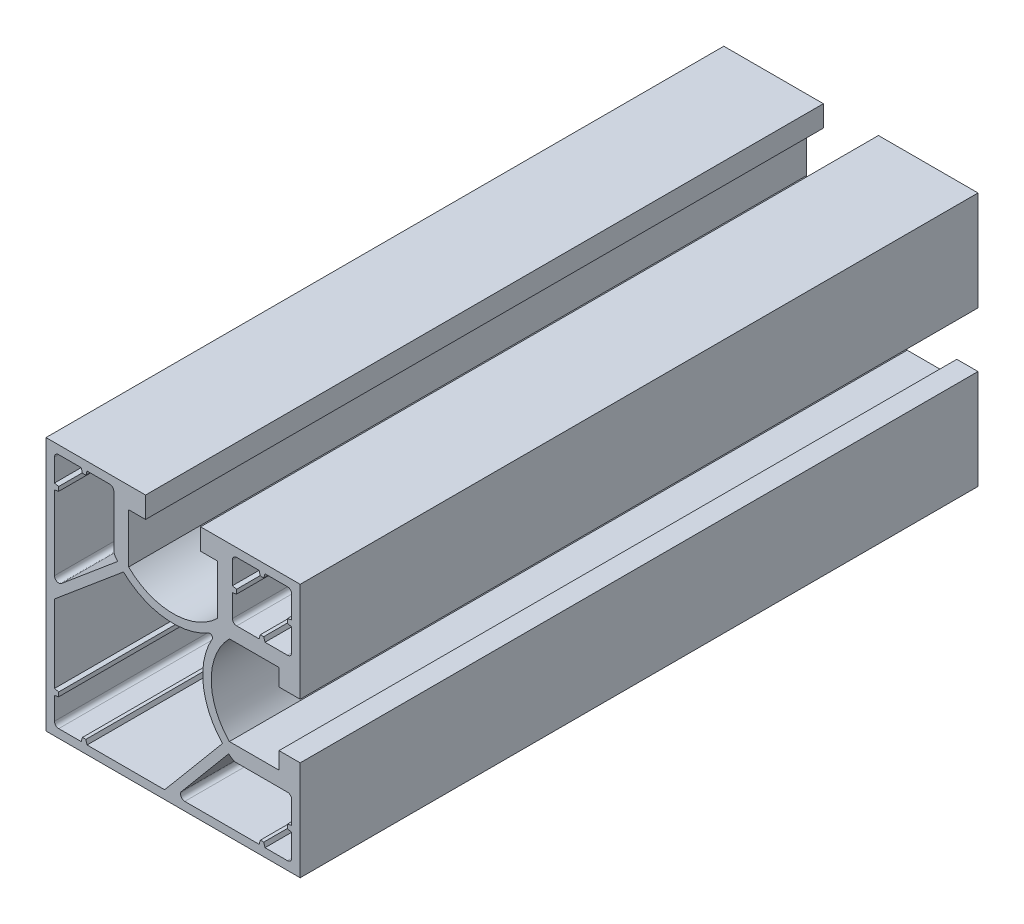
from build123d import *

# Parameters (mm, degrees)
EXTRUDE_1_DEPTH = 40
FILLET_1_R      = 0.5
FILLET_2_R      = 0.5


with BuildPart() as part:
    # Sketch 1 → Extrude 1 (new, symmetric)
    with BuildSketch(Plane.XY):
        with BuildLine():
            Line((-15, 15), (-3.25, 15))
            Line((-3.25, 15), (-3.25, 12.5))
            Line((-3.25, 12.5), (-5.25, 12.5))
            Line((-5.25, 12.5), (-5.25, 6.643928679))
            ThreePointArc((-5.25, 6.643928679), (0, 4.5), (5.25, 6.643928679))
            Line((5.25, 6.643928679), (5.25, 12.5))
            Line((5.25, 12.5), (3.25, 12.5))
            Line((3.25, 12.5), (3.25, 15))
            Line((3.25, 15), (15, 15))
            Line((15, 15), (15, 3.25))
            Line((15, 3.25), (12.5, 3.25))
            Line((12.5, 3.25), (12.5, 5.25))
            Line((12.5, 5.25), (6.643928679, 5.25))
            ThreePointArc((6.643928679, 5.25), (4.5, 0), (6.643928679, -5.25))
            Line((6.643928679, -5.25), (12.5, -5.25))
            Line((12.5, -5.25), (12.5, -3.25))
            Line((12.5, -3.25), (15, -3.25))
            Line((15, -3.25), (15, -15))
            Line((15, -15), (-15, -15))
            Line((-15, -15), (-15, 15))
        make_face()
        with BuildLine():
            Line((-7, 14), (-7, 7.5))
            ThreePointArc((-7, 7.5), (-6.948683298, 7.183772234), (-6.8, 6.9))
            ThreePointArc((-6.8, 6.9), (-6.670725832, 6.732038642), (-6.537304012, 6.56735274))
            Line((-6.537304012, 6.56735274), (-14, 0.305407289))
            Line((-14, 0.305407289), (-14, 10.15))
            Line((-14, 10.15), (-13.5, 10.25))
            Line((-13.5, 10.25), (-13.5, 10.75))
            Line((-13.5, 10.75), (-14, 10.85))
            Line((-14, 10.85), (-14, 14))
            Line((-14, 14), (-10.85, 14))
            Line((-10.85, 14), (-10.7, 13.5))
            Line((-10.7, 13.5), (-10.3, 13.5))
            Line((-10.3, 13.5), (-10.15, 14))
            Line((-10.15, 14), (-7, 14))
        make_face(mode=Mode.SUBTRACT)
        Polygon((7, 14), (10.15, 14), (10.3, 13.5), (10.7, 13.5), (10.85, 14), (14, 14), (14, 10.85), (13.5, 10.75), (13.5, 10.25), (14, 10.15), (14, 7), (10.85, 7), (10.7, 7.5), (10.3, 7.5), (10.15, 7), (7, 7), (7, 10.15), (7.5, 10.25), (7.5, 10.75), (7, 10.85), align=None, mode=Mode.SUBTRACT)
        with BuildLine():
            Line((7.5, -7), (14, -7))
            Line((14, -7), (14, -10.15))
            Line((14, -10.15), (13.5, -10.25))
            Line((13.5, -10.25), (13.5, -10.75))
            Line((13.5, -10.75), (14, -10.85))
            Line((14, -10.85), (14, -14))
            Line((14, -14), (10.85, -14))
            Line((10.85, -14), (10.7, -13.5))
            Line((10.7, -13.5), (10.3, -13.5))
            Line((10.3, -13.5), (10.15, -14))
            Line((10.15, -14), (0.305407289, -14))
            Line((0.305407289, -14), (6.56735274, -6.537304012))
            ThreePointArc((6.56735274, -6.537304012), (6.732038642, -6.670725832), (6.9, -6.8))
            ThreePointArc((6.9, -6.8), (7.183772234, -6.948683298), (7.5, -7))
        make_face(mode=Mode.SUBTRACT)
        with BuildLine():
            Line((-10.15, -14), (-10.3, -13.5))
            Line((-10.3, -13.5), (-10.7, -13.5))
            Line((-10.7, -13.5), (-10.85, -14))
            Line((-10.85, -14), (-14, -14))
            Line((-14, -14), (-14, -10.85))
            Line((-14, -10.85), (-13.5, -10.75))
            Line((-13.5, -10.75), (-13.5, -10.25))
            Line((-13.5, -10.25), (-14, -10.15))
            Line((-14, -10.15), (-14, -1))
            Line((-14, -1), (-5.852967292, 5.836172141))
            ThreePointArc((-5.852967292, 5.836172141), (-1.027619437, 3.562346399), (4.202436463, 4.611527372))
            ThreePointArc((4.202436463, 4.611527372), (4.562889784, 4.562889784), (4.611527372, 4.202436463))
            ThreePointArc((4.611527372, 4.202436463), (3.562346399, -1.027619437), (5.836172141, -5.852967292))
            Line((5.836172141, -5.852967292), (-1, -14))
            Line((-1, -14), (-10.15, -14))
        make_face(mode=Mode.SUBTRACT)
    extrude(amount=EXTRUDE_1_DEPTH, both=True)

    # Fillet 1
    fillet_1_edges = [part.edges().sort_by_distance(p)[0] for p in [
        (-7, 14, 0),
        (-14, 14, 0),
        (-14, 0.305407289, 0),
        (14, -7, 0),
        (0.305407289, -14, 0),
        (14, -14, 0),
        (-14, -14, 0),
    ]]
    fillet(fillet_1_edges, radius=FILLET_1_R)

    # Fillet 2
    fillet_2_edges = [part.edges().sort_by_distance(p)[0] for p in [
        (7, 14, 0),
        (7, 7, 0),
        (14, 7, 0),
        (14, 14, 0),
    ]]
    fillet(fillet_2_edges, radius=FILLET_2_R)


solid = part.part
